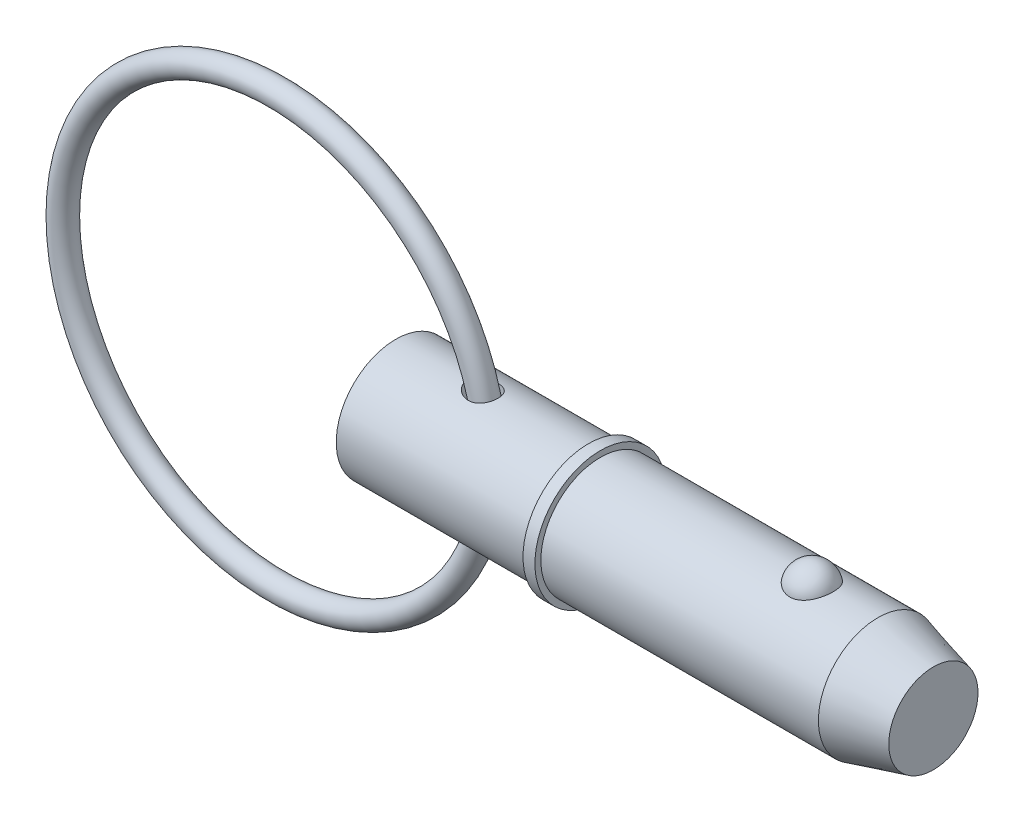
ISO-10303-21;
HEADER;
FILE_DESCRIPTION(('STEP AP214'),'2;1');
FILE_NAME('part.step','',(''),(''),'','','');
FILE_SCHEMA(('AUTOMOTIVE_DESIGN { 1 0 10303 214 1 1 1 1 }'));
ENDSEC;
DATA;
#1=APPLICATION_CONTEXT('core data for automotive mechanical design processes');
#2=APPLICATION_PROTOCOL_DEFINITION('international standard','automotive_design',2000,#1);
#3=PRODUCT_CONTEXT('',#1,'mechanical');
#4=PRODUCT('Part','Part','',(#3));
#5=PRODUCT_RELATED_PRODUCT_CATEGORY('part','',(#4));
#6=PRODUCT_DEFINITION_FORMATION('','',#4);
#7=PRODUCT_DEFINITION_CONTEXT('part definition',#1,'design');
#8=PRODUCT_DEFINITION('design','',#6,#7);
#9=PRODUCT_DEFINITION_SHAPE('','',#8);
#10=(LENGTH_UNIT() NAMED_UNIT(*) SI_UNIT(.MILLI.,.METRE.));
#11=(NAMED_UNIT(*) PLANE_ANGLE_UNIT() SI_UNIT($,.RADIAN.));
#12=(NAMED_UNIT(*) SI_UNIT($,.STERADIAN.) SOLID_ANGLE_UNIT());
#13=UNCERTAINTY_MEASURE_WITH_UNIT(LENGTH_MEASURE(1.E-05),#10,'distance_accuracy_value','');
#14=(GEOMETRIC_REPRESENTATION_CONTEXT(3) GLOBAL_UNCERTAINTY_ASSIGNED_CONTEXT((#13)) GLOBAL_UNIT_ASSIGNED_CONTEXT((#10,
#11,#12)) REPRESENTATION_CONTEXT('',''));
#15=CARTESIAN_POINT('',(0.,0.,0.));
#16=DIRECTION('',(0.,0.,1.));
#17=DIRECTION('',(1.,0.,0.));
#18=AXIS2_PLACEMENT_3D('',#15,#16,#17);
#19=CARTESIAN_POINT('',(-15.855506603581,0.,0.));
#20=DIRECTION('',(0.,0.,1.));
#21=DIRECTION('',(1.,0.,0.));
#22=AXIS2_PLACEMENT_3D('',#19,#20,#21);
#23=TOROIDAL_SURFACE('',#22,28.575,1.588);
#24=CARTESIAN_POINT('',(14.307493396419,0.,0.));
#25=VERTEX_POINT('',#24);
#26=VERTEX_LOOP('',#25);
#27=FACE_BOUND('',#26,.T.);
#28=ADVANCED_FACE('P0_F12',(#27),#23,.T.);
#29=CLOSED_SHELL('',(#28));
#30=MANIFOLD_SOLID_BREP('P0_B1',#29);
#31=CARTESIAN_POINT('',(0.,0.,0.));
#32=DIRECTION('',(1.,0.,0.));
#33=DIRECTION('',(0.,0.,-1.));
#34=AXIS2_PLACEMENT_3D('',#31,#32,#33);
#35=CYLINDRICAL_SURFACE('',#34,7.94);
#36=CARTESIAN_POINT('',(9.9064878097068,7.86092706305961,-1.11777712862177));
#37=CARTESIAN_POINT('',(9.98046148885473,7.84701054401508,-1.21564239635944));
#38=CARTESIAN_POINT('',(10.0632949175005,7.83217804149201,-1.30680329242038));
#39=CARTESIAN_POINT('',(10.243327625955,7.80247884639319,-1.47382688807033));
#40=CARTESIAN_POINT('',(10.3405572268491,7.78761214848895,-1.54965647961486));
#41=CARTESIAN_POINT('',(10.5460150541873,7.75960959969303,-1.6842723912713));
#42=CARTESIAN_POINT('',(10.654212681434,7.74646915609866,-1.74310445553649));
#43=CARTESIAN_POINT('',(10.8789333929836,7.72340979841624,-1.84259563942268));
#44=CARTESIAN_POINT('',(10.9954527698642,7.71348946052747,-1.88326279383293));
#45=CARTESIAN_POINT('',(11.2371543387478,7.69793327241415,-1.94589519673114));
#46=CARTESIAN_POINT('',(11.3624861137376,7.69242163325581,-1.96732022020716));
#47=CARTESIAN_POINT('',(11.6151110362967,7.68708151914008,-1.98809161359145));
#48=CARTESIAN_POINT('',(11.7424035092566,7.68725113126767,-1.98744541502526));
#49=CARTESIAN_POINT('',(11.9871377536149,7.69329740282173,-1.96389977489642));
#50=CARTESIAN_POINT('',(12.1047148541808,7.69883374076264,-1.94232728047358));
#51=CARTESIAN_POINT('',(12.3339179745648,7.7145667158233,-1.87886184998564));
#52=CARTESIAN_POINT('',(12.445546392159,7.72476145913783,-1.83697717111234));
#53=CARTESIAN_POINT('',(12.6521036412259,7.7477815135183,-1.73721211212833));
#54=CARTESIAN_POINT('',(12.7476463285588,7.76039274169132,-1.68054854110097));
#55=CARTESIAN_POINT('',(12.9274536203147,7.7871582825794,-1.55179691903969));
#56=CARTESIAN_POINT('',(13.0117191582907,7.8013124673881,-1.47971014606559));
#57=CARTESIAN_POINT('',(13.16544092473,7.82932755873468,-1.32341211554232));
#58=CARTESIAN_POINT('',(13.2351086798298,7.84318958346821,-1.23940873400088));
#59=CARTESIAN_POINT('',(13.3595610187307,7.86933512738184,-1.06080152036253));
#60=CARTESIAN_POINT('',(13.4143450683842,7.88161858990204,-0.966197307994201));
#61=CARTESIAN_POINT('',(13.5082288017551,7.90340571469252,-0.767990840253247));
#62=CARTESIAN_POINT('',(13.5471601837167,7.91287927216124,-0.664305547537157));
#63=CARTESIAN_POINT('',(13.6076213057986,7.92785679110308,-0.451705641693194));
#64=CARTESIAN_POINT('',(13.6291504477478,7.93336061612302,-0.342790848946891));
#65=CARTESIAN_POINT('',(13.6544025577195,7.93983472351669,-0.12204266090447));
#66=CARTESIAN_POINT('',(13.6580055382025,7.94077445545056,-0.0101946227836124));
#67=CARTESIAN_POINT('',(13.6469977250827,7.93793630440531,0.212542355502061));
#68=CARTESIAN_POINT('',(13.6323866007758,7.93415833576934,0.323431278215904));
#69=CARTESIAN_POINT('',(13.5852649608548,7.92228583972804,0.541194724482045));
#70=CARTESIAN_POINT('',(13.5527398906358,7.91418780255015,0.648065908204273));
#71=CARTESIAN_POINT('',(13.4705326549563,7.8945509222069,0.854658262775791));
#72=CARTESIAN_POINT('',(13.4208502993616,7.88301204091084,0.954379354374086));
#73=CARTESIAN_POINT('',(13.3056021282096,7.85778224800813,1.14366619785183));
#74=CARTESIAN_POINT('',(13.2400609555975,7.8440946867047,1.23324739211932));
#75=CARTESIAN_POINT('',(13.0946981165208,7.8160855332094,1.39984119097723));
#76=CARTESIAN_POINT('',(13.0148777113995,7.80176399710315,1.47685490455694));
#77=CARTESIAN_POINT('',(12.8438529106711,7.774237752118,1.61548556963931));
#78=CARTESIAN_POINT('',(12.7527554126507,7.76102428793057,1.67723263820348));
#79=CARTESIAN_POINT('',(12.5611987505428,7.73705789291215,1.78453696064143));
#80=CARTESIAN_POINT('',(12.4607407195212,7.72630466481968,1.83009617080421));
#81=CARTESIAN_POINT('',(12.2541997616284,7.70849465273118,1.90371822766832));
#82=CARTESIAN_POINT('',(12.1481665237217,7.7014098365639,1.93191408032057));
#83=CARTESIAN_POINT('',(11.9327851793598,7.69148605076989,1.97105353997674));
#84=CARTESIAN_POINT('',(11.8234367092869,7.68864754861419,1.98199524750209));
#85=CARTESIAN_POINT('',(11.6016024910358,7.68735890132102,1.98698770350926));
#86=CARTESIAN_POINT('',(11.4891069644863,7.68902083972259,1.98060702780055));
#87=CARTESIAN_POINT('',(11.2665484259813,7.6966276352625,1.95083303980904));
#88=CARTESIAN_POINT('',(11.1564861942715,7.70257384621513,1.92743434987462));
#89=CARTESIAN_POINT('',(10.9339966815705,7.71853798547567,1.86251478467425));
#90=CARTESIAN_POINT('',(10.8219140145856,7.72880438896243,1.81987394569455));
#91=CARTESIAN_POINT('',(10.6060441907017,7.75216432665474,1.7176403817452));
#92=CARTESIAN_POINT('',(10.5022611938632,7.76525926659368,1.65803922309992));
#93=CARTESIAN_POINT('',(10.3000447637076,7.79362794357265,1.51929354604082));
#94=CARTESIAN_POINT('',(10.2022480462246,7.80898310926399,1.43923272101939));
#95=CARTESIAN_POINT('',(10.0221668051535,7.83939672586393,1.26310118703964));
#96=CARTESIAN_POINT('',(9.93988168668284,7.85445518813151,1.16703109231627));
#97=CARTESIAN_POINT('',(9.79729823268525,7.88178950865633,0.964874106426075));
#98=CARTESIAN_POINT('',(9.73627994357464,7.89414970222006,0.859310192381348));
#99=CARTESIAN_POINT('',(9.63554001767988,7.91508909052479,0.638143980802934));
#100=CARTESIAN_POINT('',(9.59578986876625,7.92367334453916,0.522555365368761));
#101=CARTESIAN_POINT('',(9.54388714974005,7.93499161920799,0.300466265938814));
#102=CARTESIAN_POINT('',(9.52888458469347,7.93832727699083,0.194660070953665));
#103=CARTESIAN_POINT('',(9.51823078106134,7.94068976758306,-0.0179747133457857));
#104=CARTESIAN_POINT('',(9.52257317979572,7.93971801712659,-0.12480295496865));
#105=CARTESIAN_POINT('',(9.54911264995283,7.93386114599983,-0.326814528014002));
#106=CARTESIAN_POINT('',(9.56976509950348,7.92931471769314,-0.422217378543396));
#107=CARTESIAN_POINT('',(9.62591284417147,7.91721462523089,-0.608271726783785));
#108=CARTESIAN_POINT('',(9.66139801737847,7.90966301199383,-0.698926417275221));
#109=CARTESIAN_POINT('',(9.7317197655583,7.89515389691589,-0.844763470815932));
#110=CARTESIAN_POINT('',(9.76292633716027,7.88881879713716,-0.901801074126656));
#111=CARTESIAN_POINT('',(9.83075962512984,7.87538342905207,-1.01244242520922));
#112=CARTESIAN_POINT('',(9.86738597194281,7.86828321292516,-1.06604640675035));
#113=CARTESIAN_POINT('',(9.9064878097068,7.86092706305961,-1.11777712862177));
#114=B_SPLINE_CURVE_WITH_KNOTS('',3,(#36,#37,#38,#39,#40,#41,#42,#43,#44,#45,#46,#47,#48,#49,
#50,#51,#52,#53,#54,#55,#56,#57,#58,#59,#60,#61,#62,#63,#64,#65,#66,#67,#68,#69,#70,#71,#72,#73,
#74,#75,#76,#77,#78,#79,#80,#81,#82,#83,#84,#85,#86,#87,#88,#89,#90,#91,#92,#93,#94,#95,#96,#97,
#98,#99,#100,#101,#102,#103,#104,#105,#106,#107,#108,#109,#110,#111,#112,#113),.UNSPECIFIED.,
.T.,.F.,(4,2,2,2,2,2,2,2,2,2,2,2,2,2,2,2,2,2,2,2,2,2,2,2,2,2,2,2,2,2,2,2,2,2,2,2,2,2,4),(0.,
0.370138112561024,0.741067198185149,1.11098852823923,1.48074607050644,1.86058657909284,
2.24029919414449,2.59740885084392,2.95437345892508,3.2881332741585,3.6218654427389,
3.95036374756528,4.27887384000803,4.61078596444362,4.94270949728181,5.27685177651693,
5.61100012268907,5.94542035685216,6.27984429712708,6.61375187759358,6.94762997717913,
7.27855592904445,7.60944187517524,7.93776058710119,8.26611544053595,8.60272268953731,
8.93943635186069,9.29895306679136,9.65864886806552,10.0387340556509,10.4188046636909,
10.7843533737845,11.1494107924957,11.4683925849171,11.7872694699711,12.0791172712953,
12.3707662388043,12.5664313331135,12.7620830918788),.UNSPECIFIED.);
#115=CARTESIAN_POINT('',(9.9064878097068,7.86092706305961,-1.11777712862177));
#116=VERTEX_POINT('',#115);
#117=EDGE_CURVE('P1_E42',#116,#116,#114,.T.);
#118=ORIENTED_EDGE('',*,*,#117,.T.);
#119=EDGE_LOOP('',(#118));
#120=FACE_BOUND('',#119,.T.);
#121=CARTESIAN_POINT('',(0.,0.,0.));
#122=DIRECTION('',(1.,0.,0.));
#123=DIRECTION('',(0.,0.,-1.));
#124=AXIS2_PLACEMENT_3D('',#121,#122,#123);
#125=CIRCLE('',#124,7.94);
#126=CARTESIAN_POINT('',(0.,0.,-7.94));
#127=VERTEX_POINT('',#126);
#128=EDGE_CURVE('P1_E9',#127,#127,#125,.T.);
#129=ORIENTED_EDGE('',*,*,#128,.T.);
#130=EDGE_LOOP('',(#129));
#131=FACE_BOUND('',#130,.T.);
#132=CARTESIAN_POINT('',(25.722,0.,0.));
#133=DIRECTION('',(1.,0.,0.));
#134=DIRECTION('',(0.,0.,-1.));
#135=AXIS2_PLACEMENT_3D('',#132,#133,#134);
#136=CIRCLE('',#135,7.94);
#137=CARTESIAN_POINT('',(25.722,0.,-7.94));
#138=VERTEX_POINT('',#137);
#139=EDGE_CURVE('P1_E25',#138,#138,#136,.T.);
#140=ORIENTED_EDGE('',*,*,#139,.F.);
#141=EDGE_LOOP('',(#140));
#142=FACE_BOUND('',#141,.T.);
#143=CARTESIAN_POINT('',(9.9064878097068,-7.86092706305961,-1.11777712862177));
#144=CARTESIAN_POINT('',(9.84378768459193,-7.87272256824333,-1.03482250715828));
#145=CARTESIAN_POINT('',(9.7874122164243,-7.88386682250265,-0.947002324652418));
#146=CARTESIAN_POINT('',(9.68947008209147,-7.90377389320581,-0.763202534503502));
#147=CARTESIAN_POINT('',(9.64789384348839,-7.91253824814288,-0.667228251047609));
#148=CARTESIAN_POINT('',(9.58141396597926,-7.92676779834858,-0.468898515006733));
#149=CARTESIAN_POINT('',(9.55658638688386,-7.93221793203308,-0.366516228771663));
#150=CARTESIAN_POINT('',(9.525398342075,-7.9390896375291,-0.158837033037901));
#151=CARTESIAN_POINT('',(9.51903196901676,-7.94051249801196,-0.0535410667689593));
#152=CARTESIAN_POINT('',(9.5249639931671,-7.93919670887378,0.149856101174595));
#153=CARTESIAN_POINT('',(9.53611757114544,-7.9367132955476,0.247994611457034));
#154=CARTESIAN_POINT('',(9.57435037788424,-7.92833496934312,0.440949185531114));
#155=CARTESIAN_POINT('',(9.60143086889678,-7.92243978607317,0.535764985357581));
#156=CARTESIAN_POINT('',(9.67027872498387,-7.90782830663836,0.720026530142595));
#157=CARTESIAN_POINT('',(9.71210005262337,-7.89910165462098,0.809451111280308));
#158=CARTESIAN_POINT('',(9.80864905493,-7.87966534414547,0.980775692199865));
#159=CARTESIAN_POINT('',(9.86338092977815,-7.86895504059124,1.06267323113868));
#160=CARTESIAN_POINT('',(9.99009906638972,-7.84531573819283,1.22559225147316));
#161=CARTESIAN_POINT('',(10.0632770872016,-7.8322718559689,1.30566871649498));
#162=CARTESIAN_POINT('',(10.2208237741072,-7.80611237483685,1.45392159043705));
#163=CARTESIAN_POINT('',(10.3051986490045,-7.79299674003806,1.52209134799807));
#164=CARTESIAN_POINT('',(10.4935539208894,-7.76638841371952,1.65280871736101));
#165=CARTESIAN_POINT('',(10.5986730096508,-7.75303312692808,1.71374951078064));
#166=CARTESIAN_POINT('',(10.8175805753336,-7.72920597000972,1.81820073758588));
#167=CARTESIAN_POINT('',(10.9313721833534,-7.71873514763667,1.86170483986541));
#168=CARTESIAN_POINT('',(11.1696833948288,-7.70161777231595,1.93133079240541));
#169=CARTESIAN_POINT('',(11.2944525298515,-7.69514907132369,1.95665138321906));
#170=CARTESIAN_POINT('',(11.5466607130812,-7.6877908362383,1.98537345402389));
#171=CARTESIAN_POINT('',(11.6740986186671,-7.68689896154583,1.98878412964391));
#172=CARTESIAN_POINT('',(11.9206005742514,-7.690938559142,1.97309854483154));
#173=CARTESIAN_POINT('',(12.0397453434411,-7.69555832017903,1.95520713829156));
#174=CARTESIAN_POINT('',(12.2727177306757,-7.70968728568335,1.89872693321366));
#175=CARTESIAN_POINT('',(12.3865475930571,-7.71919440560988,1.86014695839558));
#176=CARTESIAN_POINT('',(12.5975118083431,-7.74115679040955,1.76641559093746));
#177=CARTESIAN_POINT('',(12.6952552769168,-7.75336701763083,1.71257254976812));
#178=CARTESIAN_POINT('',(12.8798510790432,-7.77962828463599,1.58901145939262));
#179=CARTESIAN_POINT('',(12.9667044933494,-7.79367914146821,1.51929498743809));
#180=CARTESIAN_POINT('',(13.1254818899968,-7.82172079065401,1.36751778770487));
#181=CARTESIAN_POINT('',(13.1976693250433,-7.83570718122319,1.28573131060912));
#182=CARTESIAN_POINT('',(13.3274495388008,-7.86236718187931,1.11111271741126));
#183=CARTESIAN_POINT('',(13.3850418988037,-7.87504075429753,1.01828028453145));
#184=CARTESIAN_POINT('',(13.4847470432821,-7.89782512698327,0.823214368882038));
#185=CARTESIAN_POINT('',(13.5267056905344,-7.90791011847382,0.720899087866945));
#186=CARTESIAN_POINT('',(13.5933891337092,-7.92427335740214,0.510509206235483));
#187=CARTESIAN_POINT('',(13.6181132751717,-7.9305514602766,0.402434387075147));
#188=CARTESIAN_POINT('',(13.6498843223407,-7.93866355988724,0.182728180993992));
#189=CARTESIAN_POINT('',(13.6567982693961,-7.94046412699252,0.07107630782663));
#190=CARTESIAN_POINT('',(13.6524060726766,-7.93933046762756,-0.151845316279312));
#191=CARTESIAN_POINT('',(13.6410996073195,-7.93639615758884,-0.26311506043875));
#192=CARTESIAN_POINT('',(13.6005023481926,-7.92610202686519,-0.482238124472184));
#193=CARTESIAN_POINT('',(13.571192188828,-7.91873744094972,-0.590087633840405));
#194=CARTESIAN_POINT('',(13.495246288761,-7.90037565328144,-0.799178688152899));
#195=CARTESIAN_POINT('',(13.4486102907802,-7.88937839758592,-0.900420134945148));
#196=CARTESIAN_POINT('',(13.3391817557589,-7.86497175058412,-1.09328280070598));
#197=CARTESIAN_POINT('',(13.2764083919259,-7.85156522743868,-1.18491525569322));
#198=CARTESIAN_POINT('',(13.1362355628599,-7.8238261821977,-1.35604994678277));
#199=CARTESIAN_POINT('',(13.0588372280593,-7.80949373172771,-1.43555311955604));
#200=CARTESIAN_POINT('',(12.8921392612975,-7.78164292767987,-1.57955181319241));
#201=CARTESIAN_POINT('',(12.8029410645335,-7.76811892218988,-1.64416363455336));
#202=CARTESIAN_POINT('',(12.6146622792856,-7.74328422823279,-1.75742016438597));
#203=CARTESIAN_POINT('',(12.5155829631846,-7.73197325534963,-1.80606692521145));
#204=CARTESIAN_POINT('',(12.31135301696,-7.71289290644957,-1.88588502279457));
#205=CARTESIAN_POINT('',(12.2062651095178,-7.70509254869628,-1.91720981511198));
#206=CARTESIAN_POINT('',(11.9922253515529,-7.69365188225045,-1.96261878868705));
#207=CARTESIAN_POINT('',(11.8832731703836,-7.69001193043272,-1.97670149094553));
#208=CARTESIAN_POINT('',(11.662174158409,-7.6871142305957,-1.98794112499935));
#209=CARTESIAN_POINT('',(11.5500082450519,-7.6879499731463,-1.98473694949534));
#210=CARTESIAN_POINT('',(11.3276038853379,-7.69396349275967,-1.96129119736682));
#211=CARTESIAN_POINT('',(11.2173659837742,-7.6991424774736,-1.94104488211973));
#212=CARTESIAN_POINT('',(10.9943151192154,-7.71363470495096,-1.8826578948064));
#213=CARTESIAN_POINT('',(10.8818004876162,-7.72319478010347,-1.8434396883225));
#214=CARTESIAN_POINT('',(10.6644693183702,-7.74534199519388,-1.74804607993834));
#215=CARTESIAN_POINT('',(10.5596578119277,-7.75793109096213,-1.69185971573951));
#216=CARTESIAN_POINT('',(10.3538333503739,-7.78563853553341,-1.5595801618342));
#217=CARTESIAN_POINT('',(10.2535123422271,-7.80086820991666,-1.48242881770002));
#218=CARTESIAN_POINT('',(10.0678634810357,-7.83136022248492,-1.31182139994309));
#219=CARTESIAN_POINT('',(9.98252491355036,-7.84662252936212,-1.21837707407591));
#220=CARTESIAN_POINT('',(9.9064878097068,-7.86092706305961,-1.11777712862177));
#221=B_SPLINE_CURVE_WITH_KNOTS('',3,(#143,#144,#145,#146,#147,#148,#149,#150,#151,#152,#153,
#154,#155,#156,#157,#158,#159,#160,#161,#162,#163,#164,#165,#166,#167,#168,#169,#170,#171,#172,
#173,#174,#175,#176,#177,#178,#179,#180,#181,#182,#183,#184,#185,#186,#187,#188,#189,#190,#191,
#192,#193,#194,#195,#196,#197,#198,#199,#200,#201,#202,#203,#204,#205,#206,#207,#208,#209,#210,
#211,#212,#213,#214,#215,#216,#217,#218,#219,#220),.UNSPECIFIED.,.T.,.F.,(4,2,2,2,2,2,2,2,2,2,2,
2,2,2,2,2,2,2,2,2,2,2,2,2,2,2,2,2,2,2,2,2,2,2,2,2,2,2,4),(0.,0.313593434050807,
0.626983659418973,0.941787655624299,1.25649090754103,1.55146990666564,1.84647228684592,
2.14256601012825,2.4387561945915,2.76521830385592,3.09186220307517,3.45696288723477,
3.82219601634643,4.20267276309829,4.58298981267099,4.94277962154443,5.30241610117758,
5.63754619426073,5.97264300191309,6.301049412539,6.62946524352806,6.96103833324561,
7.29262401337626,7.62667800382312,7.96073789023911,8.29515773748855,8.6295825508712,
8.96361184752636,9.29761533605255,9.62891449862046,9.96017105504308,10.288443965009,
10.616745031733,10.951930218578,11.2872086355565,11.6442788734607,12.0015802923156,
12.3821516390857,12.762449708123),.UNSPECIFIED.);
#222=CARTESIAN_POINT('',(9.9064878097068,-7.86092706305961,-1.11777712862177));
#223=VERTEX_POINT('',#222);
#224=EDGE_CURVE('P1_E17',#223,#223,#221,.T.);
#225=ORIENTED_EDGE('',*,*,#224,.T.);
#226=EDGE_LOOP('',(#225));
#227=FACE_BOUND('',#226,.T.);
#228=ADVANCED_FACE('P1_F13',(#120,#131,#142,#227),#35,.T.);
#229=CARTESIAN_POINT('',(0.,0.,0.));
#230=DIRECTION('',(1.,0.,0.));
#231=DIRECTION('',(0.,0.,-1.));
#232=AXIS2_PLACEMENT_3D('',#229,#230,#231);
#233=CYLINDRICAL_SURFACE('',#232,7.94);
#234=CARTESIAN_POINT('',(64.3518791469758,0.,0.));
#235=DIRECTION('',(1.,0.,0.));
#236=DIRECTION('',(0.,0.,-1.));
#237=AXIS2_PLACEMENT_3D('',#234,#235,#236);
#238=CIRCLE('',#237,7.94);
#239=CARTESIAN_POINT('',(64.3518791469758,0.,-7.94));
#240=VERTEX_POINT('',#239);
#241=EDGE_CURVE('P1_E99',#240,#240,#238,.T.);
#242=ORIENTED_EDGE('',*,*,#241,.F.);
#243=EDGE_LOOP('',(#242));
#244=FACE_BOUND('',#243,.T.);
#245=CARTESIAN_POINT('',(27.31,0.,0.));
#246=DIRECTION('',(1.,0.,0.));
#247=DIRECTION('',(0.,0.,-1.));
#248=AXIS2_PLACEMENT_3D('',#245,#246,#247);
#249=CIRCLE('',#248,7.94);
#250=CARTESIAN_POINT('',(27.31,0.,-7.94));
#251=VERTEX_POINT('',#250);
#252=EDGE_CURVE('P1_E96',#251,#251,#249,.T.);
#253=ORIENTED_EDGE('',*,*,#252,.T.);
#254=EDGE_LOOP('',(#253));
#255=FACE_BOUND('',#254,.T.);
#256=CARTESIAN_POINT('',(55.5449074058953,7.37767842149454,2.93486986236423));
#257=CARTESIAN_POINT('',(55.3927496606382,7.3776732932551,2.93487505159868));
#258=CARTESIAN_POINT('',(55.2406329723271,7.38258419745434,2.92262454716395));
#259=CARTESIAN_POINT('',(54.9409284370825,7.40163229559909,2.87404196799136));
#260=CARTESIAN_POINT('',(54.7933394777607,7.41576720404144,2.83771585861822));
#261=CARTESIAN_POINT('',(54.5070187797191,7.4516157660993,2.74218769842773));
#262=CARTESIAN_POINT('',(54.3682745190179,7.47331841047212,2.68301886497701));
#263=CARTESIAN_POINT('',(54.1028822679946,7.52194082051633,2.54350967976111));
#264=CARTESIAN_POINT('',(53.9762366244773,7.5488615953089,2.46316523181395));
#265=CARTESIAN_POINT('',(53.7345349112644,7.60594671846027,2.2809037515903));
#266=CARTESIAN_POINT('',(53.6199065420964,7.63618114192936,2.17844211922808));
#267=CARTESIAN_POINT('',(53.4088787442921,7.69614046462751,1.95608495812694));
#268=CARTESIAN_POINT('',(53.3124826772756,7.72586526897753,1.83618622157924));
#269=CARTESIAN_POINT('',(53.1359381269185,7.78314821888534,1.57628086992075));
#270=CARTESIAN_POINT('',(53.0567072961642,7.81055035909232,1.43561546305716));
#271=CARTESIAN_POINT('',(52.9217979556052,7.85879631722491,1.14236334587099));
#272=CARTESIAN_POINT('',(52.8661216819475,7.87963951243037,0.989775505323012));
#273=CARTESIAN_POINT('',(52.7788121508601,7.91289645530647,0.674619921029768));
#274=CARTESIAN_POINT('',(52.7475309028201,7.925186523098,0.511941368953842));
#275=CARTESIAN_POINT('',(52.710975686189,7.93958930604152,0.183247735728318));
#276=CARTESIAN_POINT('',(52.7057012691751,7.94170219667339,0.0172327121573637));
#277=CARTESIAN_POINT('',(52.7212311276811,7.93554931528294,-0.31267286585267));
#278=CARTESIAN_POINT('',(52.7419253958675,7.92732732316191,-0.4765694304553));
#279=CARTESIAN_POINT('',(52.8087865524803,7.90141534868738,-0.798305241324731));
#280=CARTESIAN_POINT('',(52.8549539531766,7.88372517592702,-0.956144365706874));
#281=CARTESIAN_POINT('',(52.9718986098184,7.84066230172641,-1.26152073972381));
#282=CARTESIAN_POINT('',(53.0427046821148,7.81528060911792,-1.40904568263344));
#283=CARTESIAN_POINT('',(53.2074789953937,7.7594867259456,-1.68950598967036));
#284=CARTESIAN_POINT('',(53.3014488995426,7.72907417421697,-1.82244030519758));
#285=CARTESIAN_POINT('',(53.5108391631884,7.66640424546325,-2.07032792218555));
#286=CARTESIAN_POINT('',(53.6263152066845,7.63414223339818,-2.1852330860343));
#287=CARTESIAN_POINT('',(53.8759006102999,7.57149681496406,-2.39329737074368));
#288=CARTESIAN_POINT('',(54.0100080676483,7.54111321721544,-2.48645870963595));
#289=CARTESIAN_POINT('',(54.2901113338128,7.48650742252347,-2.64628132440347));
#290=CARTESIAN_POINT('',(54.4357605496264,7.46215900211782,-2.71350554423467));
#291=CARTESIAN_POINT('',(54.7374259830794,7.42171253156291,-2.82226614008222));
#292=CARTESIAN_POINT('',(54.8934383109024,7.40561140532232,-2.86381209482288));
#293=CARTESIAN_POINT('',(55.2029708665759,7.3842679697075,-2.9183907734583));
#294=CARTESIAN_POINT('',(55.3562229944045,7.37852109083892,-2.93275024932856));
#295=CARTESIAN_POINT('',(55.6630705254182,7.37700973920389,-2.93655208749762));
#296=CARTESIAN_POINT('',(55.8166658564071,7.38124333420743,-2.92599927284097));
#297=CARTESIAN_POINT('',(56.1149907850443,7.39890635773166,-2.88102897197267));
#298=CARTESIAN_POINT('',(56.2598480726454,7.41205491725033,-2.8473399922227));
#299=CARTESIAN_POINT('',(56.5416432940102,7.445801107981,-2.75788206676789));
#300=CARTESIAN_POINT('',(56.6785805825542,7.46639934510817,-2.70211132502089));
#301=CARTESIAN_POINT('',(56.9440619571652,7.51339098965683,-2.56858908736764));
#302=CARTESIAN_POINT('',(57.0723548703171,7.53990200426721,-2.49038067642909));
#303=CARTESIAN_POINT('',(57.3142440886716,7.59569503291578,-2.31462737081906));
#304=CARTESIAN_POINT('',(57.4278370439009,7.62497767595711,-2.21707808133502));
#305=CARTESIAN_POINT('',(57.64322156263,7.68489473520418,-1.99982049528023));
#306=CARTESIAN_POINT('',(57.7441488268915,7.71552419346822,-1.87925337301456));
#307=CARTESIAN_POINT('',(57.9251866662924,7.77353016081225,-1.62268826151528));
#308=CARTESIAN_POINT('',(58.0052934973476,7.80090608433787,-1.4866875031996));
#309=CARTESIAN_POINT('',(58.1453615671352,7.85047992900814,-1.19818413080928));
#310=CARTESIAN_POINT('',(58.2045877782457,7.8724818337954,-1.04529016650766));
#311=CARTESIAN_POINT('',(58.2979821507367,7.90785114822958,-0.731080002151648));
#312=CARTESIAN_POINT('',(58.3321497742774,7.92121837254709,-0.569763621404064));
#313=CARTESIAN_POINT('',(58.374795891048,7.93797834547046,-0.242812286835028));
#314=CARTESIAN_POINT('',(58.3832047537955,7.94134405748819,-0.0771668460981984));
#315=CARTESIAN_POINT('',(58.3739626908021,7.93767937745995,0.253276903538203));
#316=CARTESIAN_POINT('',(58.3563120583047,7.93064910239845,0.418075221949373));
#317=CARTESIAN_POINT('',(58.2954247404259,7.90695571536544,0.741525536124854));
#318=CARTESIAN_POINT('',(58.2522819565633,7.8903279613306,0.900197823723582));
#319=CARTESIAN_POINT('',(58.1413535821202,7.84916386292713,1.20759654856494));
#320=CARTESIAN_POINT('',(58.07356656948,7.82462706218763,1.35632241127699));
#321=CARTESIAN_POINT('',(57.9143718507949,7.7700669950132,1.64032869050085));
#322=CARTESIAN_POINT('',(57.8228616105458,7.7400200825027,1.77554712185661));
#323=CARTESIAN_POINT('',(57.6182960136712,7.67774175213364,2.02800648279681));
#324=CARTESIAN_POINT('',(57.5052410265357,7.64551037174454,2.14524772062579));
#325=CARTESIAN_POINT('',(57.2608318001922,7.58265895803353,2.35778002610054));
#326=CARTESIAN_POINT('',(57.1295833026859,7.5520309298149,2.45319004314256));
#327=CARTESIAN_POINT('',(56.851601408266,7.49579792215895,2.61999897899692));
#328=CARTESIAN_POINT('',(56.7048670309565,7.47019326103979,2.69139637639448));
#329=CARTESIAN_POINT('',(56.3929477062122,7.42622216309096,2.8105324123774));
#330=CARTESIAN_POINT('',(56.2272209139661,7.40825002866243,2.85700910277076));
#331=CARTESIAN_POINT('',(55.8892792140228,7.38398348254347,2.9191685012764));
#332=CARTESIAN_POINT('',(55.7170670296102,7.3776842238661,2.93486399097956));
#333=CARTESIAN_POINT('',(55.5449074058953,7.37767842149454,2.93486986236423));
#334=B_SPLINE_CURVE_WITH_KNOTS('',3,(#256,#257,#258,#259,#260,#261,#262,#263,#264,#265,#266,
#267,#268,#269,#270,#271,#272,#273,#274,#275,#276,#277,#278,#279,#280,#281,#282,#283,#284,#285,
#286,#287,#288,#289,#290,#291,#292,#293,#294,#295,#296,#297,#298,#299,#300,#301,#302,#303,#304,
#305,#306,#307,#308,#309,#310,#311,#312,#313,#314,#315,#316,#317,#318,#319,#320,#321,#322,#323,
#324,#325,#326,#327,#328,#329,#330,#331,#332,#333),.UNSPECIFIED.,.T.,.F.,(4,2,2,2,2,2,2,2,2,2,2,
2,2,2,2,2,2,2,2,2,2,2,2,2,2,2,2,2,2,2,2,2,2,2,2,2,2,2,4),(0.,0.45584132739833,0.911569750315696,
1.36663794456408,1.82179423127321,2.28978983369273,2.7578716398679,3.246853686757,
3.73588214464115,4.23184282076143,4.72779494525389,5.22165321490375,5.71552141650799,
6.20996917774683,6.70445245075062,7.20023431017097,7.69596557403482,8.18023418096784,
8.66432203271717,9.12410697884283,9.58380291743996,10.0296503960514,10.4755341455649,
10.9312349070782,11.3870393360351,11.8654416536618,12.3439299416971,12.8378875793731,
13.3318558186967,13.8271581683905,14.3224549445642,14.8159385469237,15.3094506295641,
15.8051323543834,16.3008055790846,16.7937101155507,17.2866458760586,17.8026240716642,
18.3183879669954),.UNSPECIFIED.);
#335=CARTESIAN_POINT('',(55.5449074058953,7.37767842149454,2.93486986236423));
#336=VERTEX_POINT('',#335);
#337=EDGE_CURVE('P1_E34',#336,#336,#334,.T.);
#338=ORIENTED_EDGE('',*,*,#337,.T.);
#339=EDGE_LOOP('',(#338));
#340=FACE_BOUND('',#339,.T.);
#341=ADVANCED_FACE('P1_F46',(#244,#255,#340),#233,.T.);
#342=CARTESIAN_POINT('',(0.,0.,0.));
#343=DIRECTION('',(-1.,0.,0.));
#344=DIRECTION('',(0.,0.,1.));
#345=AXIS2_PLACEMENT_3D('',#342,#343,#344);
#346=PLANE('',#345);
#347=ORIENTED_EDGE('',*,*,#128,.F.);
#348=EDGE_LOOP('',(#347));
#349=FACE_BOUND('',#348,.T.);
#350=ADVANCED_FACE('P1_F15',(#349),#346,.T.);
#351=CARTESIAN_POINT('',(25.722,7.94,0.));
#352=DIRECTION('',(-1.,0.,0.));
#353=DIRECTION('',(0.,0.,1.));
#354=AXIS2_PLACEMENT_3D('',#351,#352,#353);
#355=PLANE('',#354);
#356=ORIENTED_EDGE('',*,*,#139,.T.);
#357=EDGE_LOOP('',(#356));
#358=FACE_BOUND('',#357,.T.);
#359=CARTESIAN_POINT('',(25.722,0.,0.));
#360=DIRECTION('',(1.,0.,0.));
#361=DIRECTION('',(0.,0.,-1.));
#362=AXIS2_PLACEMENT_3D('',#359,#360,#361);
#363=CIRCLE('',#362,8.734);
#364=CARTESIAN_POINT('',(25.722,0.,-8.734));
#365=VERTEX_POINT('',#364);
#366=EDGE_CURVE('P1_E30',#365,#365,#363,.T.);
#367=ORIENTED_EDGE('',*,*,#366,.F.);
#368=EDGE_LOOP('',(#367));
#369=FACE_BOUND('',#368,.T.);
#370=ADVANCED_FACE('P1_F81',(#358,#369),#355,.T.);
#371=CARTESIAN_POINT('',(0.,0.,0.));
#372=DIRECTION('',(1.,0.,0.));
#373=DIRECTION('',(0.,0.,-1.));
#374=AXIS2_PLACEMENT_3D('',#371,#372,#373);
#375=CYLINDRICAL_SURFACE('',#374,8.734);
#376=ORIENTED_EDGE('',*,*,#366,.T.);
#377=EDGE_LOOP('',(#376));
#378=FACE_BOUND('',#377,.T.);
#379=CARTESIAN_POINT('',(27.31,0.,0.));
#380=DIRECTION('',(1.,0.,0.));
#381=DIRECTION('',(0.,0.,-1.));
#382=AXIS2_PLACEMENT_3D('',#379,#380,#381);
#383=CIRCLE('',#382,8.734);
#384=CARTESIAN_POINT('',(27.31,0.,-8.734));
#385=VERTEX_POINT('',#384);
#386=EDGE_CURVE('P1_E95',#385,#385,#383,.T.);
#387=ORIENTED_EDGE('',*,*,#386,.F.);
#388=EDGE_LOOP('',(#387));
#389=FACE_BOUND('',#388,.T.);
#390=ADVANCED_FACE('P1_F68',(#378,#389),#375,.T.);
#391=CARTESIAN_POINT('',(27.31,8.734,0.));
#392=DIRECTION('',(1.,0.,0.));
#393=DIRECTION('',(0.,0.,-1.));
#394=AXIS2_PLACEMENT_3D('',#391,#392,#393);
#395=PLANE('',#394);
#396=ORIENTED_EDGE('',*,*,#386,.T.);
#397=EDGE_LOOP('',(#396));
#398=FACE_BOUND('',#397,.T.);
#399=ORIENTED_EDGE('',*,*,#252,.F.);
#400=EDGE_LOOP('',(#399));
#401=FACE_BOUND('',#400,.T.);
#402=ADVANCED_FACE('P1_F62',(#398,#401),#395,.T.);
#403=CARTESIAN_POINT('',(71.76,0.,0.));
#404=DIRECTION('',(-1.,0.,0.));
#405=DIRECTION('',(0.,0.,1.));
#406=AXIS2_PLACEMENT_3D('',#403,#404,#405);
#407=CONICAL_SURFACE('',#406,5.95500000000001,0.26179938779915);
#408=ORIENTED_EDGE('',*,*,#241,.T.);
#409=EDGE_LOOP('',(#408));
#410=FACE_BOUND('',#409,.T.);
#411=CARTESIAN_POINT('',(71.76,0.,0.));
#412=DIRECTION('',(1.,0.,0.));
#413=DIRECTION('',(0.,0.,-1.));
#414=AXIS2_PLACEMENT_3D('',#411,#412,#413);
#415=CIRCLE('',#414,5.95500000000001);
#416=CARTESIAN_POINT('',(71.76,0.,-5.95500000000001));
#417=VERTEX_POINT('',#416);
#418=EDGE_CURVE('P1_E41',#417,#417,#415,.T.);
#419=ORIENTED_EDGE('',*,*,#418,.F.);
#420=EDGE_LOOP('',(#419));
#421=FACE_BOUND('',#420,.T.);
#422=ADVANCED_FACE('P1_F59',(#410,#421),#407,.T.);
#423=CARTESIAN_POINT('',(71.76,5.95500000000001,0.));
#424=DIRECTION('',(1.,0.,0.));
#425=DIRECTION('',(0.,0.,-1.));
#426=AXIS2_PLACEMENT_3D('',#423,#424,#425);
#427=PLANE('',#426);
#428=ORIENTED_EDGE('',*,*,#418,.T.);
#429=EDGE_LOOP('',(#428));
#430=FACE_BOUND('',#429,.T.);
#431=ADVANCED_FACE('P1_F55',(#430),#427,.T.);
#432=CARTESIAN_POINT('',(55.5449074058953,7.146,0.));
#433=DIRECTION('',(-1.,0.,0.));
#434=DIRECTION('',(0.,1.,0.));
#435=AXIS2_PLACEMENT_3D('',#432,#433,#434);
#436=SPHERICAL_SURFACE('',#435,2.944);
#437=ORIENTED_EDGE('',*,*,#337,.F.);
#438=EDGE_LOOP('',(#437));
#439=FACE_BOUND('',#438,.T.);
#440=ADVANCED_FACE('P1_F50',(#439),#436,.T.);
#441=CARTESIAN_POINT('',(-15.855506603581,0.,0.));
#442=DIRECTION('',(0.,0.,1.));
#443=DIRECTION('',(1.,0.,0.));
#444=AXIS2_PLACEMENT_3D('',#441,#442,#443);
#445=TOROIDAL_SURFACE('',#444,28.575,1.985);
#446=ORIENTED_EDGE('',*,*,#224,.F.);
#447=EDGE_LOOP('',(#446));
#448=FACE_BOUND('',#447,.T.);
#449=ORIENTED_EDGE('',*,*,#117,.F.);
#450=EDGE_LOOP('',(#449));
#451=FACE_BOUND('',#450,.T.);
#452=ADVANCED_FACE('P1_F54',(#448,#451),#445,.F.);
#453=CLOSED_SHELL('',(#228,#341,#350,#370,#390,#402,#422,#431,#440,#452));
#454=MANIFOLD_SOLID_BREP('P1_B1',#453);
#455=ADVANCED_BREP_SHAPE_REPRESENTATION('',(#18,#30,#454),#14);
#456=SHAPE_DEFINITION_REPRESENTATION(#9,#455);
ENDSEC;
END-ISO-10303-21;
